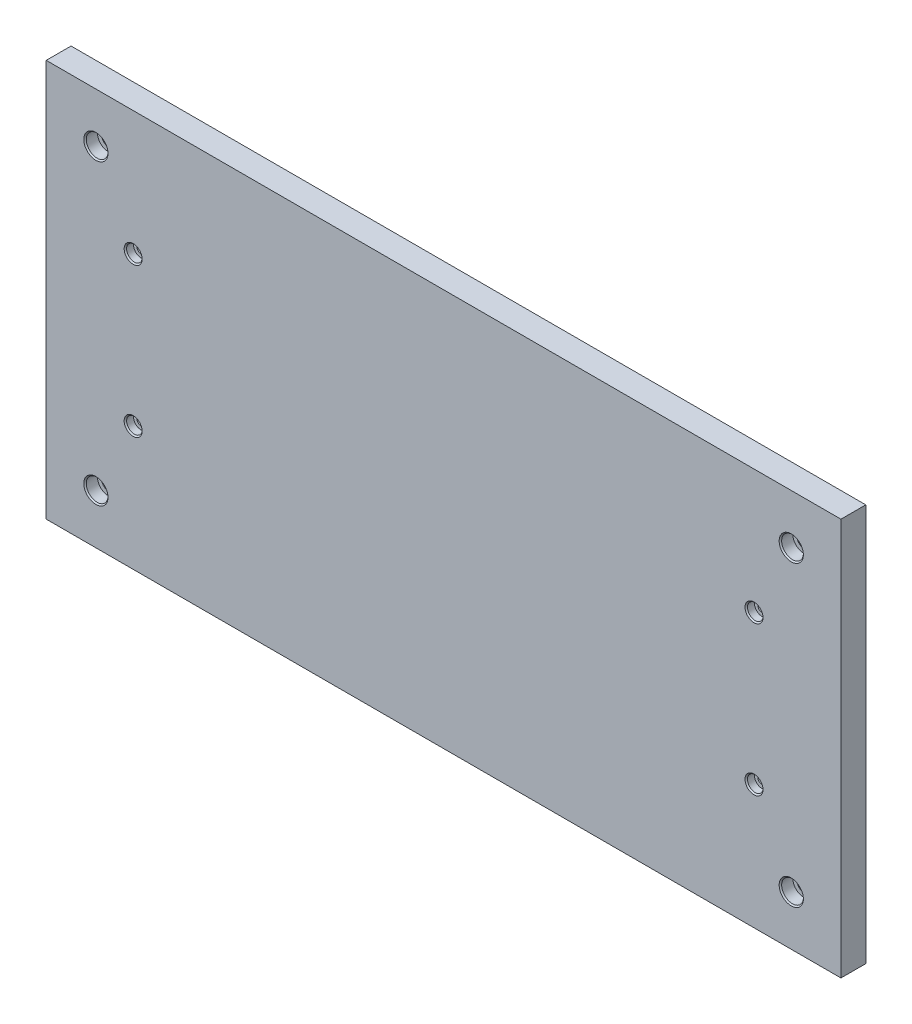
from build123d import *

# Parameters (mm, degrees)
SKETCH1_W                                     = 406.4
SKETCH1_H                                     = 203.2
BOSS_EXTRUDE1_DEPTH                           = 12.7
CBORE_FOR_1_4_SOCKET_HEAD_CAP_SCREW1_AT_COUNT = 2
CBORE_FOR_1_4_SOCKET_HEAD_CAP_SCREW1_AT_PITCH = 152.4
CBORE_FOR_1_4_SOCKET_HEAD_CAP_SCREW1_2_COUNT  = 2
CBORE_FOR_1_4_SOCKET_HEAD_CAP_SCREW1_2_PITCH  = 386.881273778
CBORE_FOR_1_4_SOCKET_HEAD_CAP_SCREW1_3_COUNT  = 2
CBORE_FOR_1_4_SOCKET_HEAD_CAP_SCREW1_3_PITCH  = 355.6
CBORE_FOR_8_SOCKET_HEAD_CAP_SCREW2_AT_2_COUNT = 2
CBORE_FOR_8_SOCKET_HEAD_CAP_SCREW2_AT_2_PITCH = 326.515987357
CBORE_FOR_8_SOCKET_HEAD_CAP_SCREW2_AT_3_COUNT = 2
CBORE_FOR_8_SOCKET_HEAD_CAP_SCREW2_AT_3_PITCH = 317.5


with BuildPart() as part:
    # Sketch1 → Boss-Extrude1 (new body)
    with BuildSketch(Plane.XY):
        with Locations((95.867780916, -141.83523601)):
            Rectangle(SKETCH1_W, SKETCH1_H)
    extrude(amount=BOSS_EXTRUDE1_DEPTH)

    # Sketch3 → CBORE for 1_4 Socket Head Cap Screw1 (revolve, cut)
    with BuildSketch(Plane(origin=(-81.932219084, -65.63523601, 12.7), x_dir=(0, -1, 0), z_dir=(1, 0, 0))):
        Polygon((0, 0), (0, 12.7), (3.3782, 12.7), (3.3782, 6.35), (5.55625, 6.35), (5.55625, 0.635), (6.19125, 0), align=None)
    cbore_for_1_4_socket_head_cap_screw1 = revolve(axis=Axis((-81.932219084, -65.63523601, 19.05), (0, 0, -1)), mode=Mode.SUBTRACT)

    # CBORE for 1_4 Socket Head Cap Screw1 at: CBORE for 1_4 Socket Head Cap Screw1 ×2
    with Locations(*[(0, -i * CBORE_FOR_1_4_SOCKET_HEAD_CAP_SCREW1_AT_PITCH, 0) for i in range(1, CBORE_FOR_1_4_SOCKET_HEAD_CAP_SCREW1_AT_COUNT)]):
        add(cbore_for_1_4_socket_head_cap_screw1, mode=Mode.SUBTRACT)

    # CBORE for 1_4 Socket Head Cap Screw1 2: CBORE for 1_4 Socket Head Cap Screw1 ×2
    with Locations(*[Vector(0.919145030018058, -0.39391929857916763, 0) * (i * CBORE_FOR_1_4_SOCKET_HEAD_CAP_SCREW1_2_PITCH) for i in range(1, CBORE_FOR_1_4_SOCKET_HEAD_CAP_SCREW1_2_COUNT)]):
        add(cbore_for_1_4_socket_head_cap_screw1, mode=Mode.SUBTRACT)

    # CBORE for 1_4 Socket Head Cap Screw1 3: CBORE for 1_4 Socket Head Cap Screw1 ×2
    with Locations(*[(i * CBORE_FOR_1_4_SOCKET_HEAD_CAP_SCREW1_3_PITCH, 0, 0) for i in range(1, CBORE_FOR_1_4_SOCKET_HEAD_CAP_SCREW1_3_COUNT)]):
        add(cbore_for_1_4_socket_head_cap_screw1, mode=Mode.SUBTRACT)

    # Sketch5 → CBORE for _8 Socket Head Cap Screw1 (revolve, cut)
    with BuildSketch(Plane(origin=(-62.882219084, -103.73523601, 12.7), x_dir=(0, -1, 0), z_dir=(1, 0, 0))):
        Polygon((0, 0), (0, 11.510674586), (2.2479, 10.16), (2.2479, 4.1656), (3.96875, 4.1656), (3.96875, 0.635), (4.60375, 0), align=None)
    revolve(axis=Axis((-62.882219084, -103.73523601, 19.05), (0, 0, -1)), mode=Mode.SUBTRACT)

    # Sketch7 → CBORE for _8 Socket Head Cap Screw2 (revolve, cut)
    with BuildSketch(Plane(origin=(-62.882219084, -179.93523601, 12.7), x_dir=(0, -1, 0), z_dir=(1, 0, 0))):
        Polygon((0, 0), (0, 11.510674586), (2.2479, 10.16), (2.2479, 4.1656), (3.96875, 4.1656), (3.96875, 0.635), (4.60375, 0), align=None)
    cbore_for_8_socket_head_cap_screw2 = revolve(axis=Axis((-62.882219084, -179.93523601, 19.05), (0, 0, -1)), mode=Mode.SUBTRACT)

    # CBORE for _8 Socket Head Cap Screw2 at 2: CBORE for _8 Socket Head Cap Screw2 ×2
    with Locations(*[Vector(0.9723873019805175, 0.23337295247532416, 0) * (i * CBORE_FOR_8_SOCKET_HEAD_CAP_SCREW2_AT_2_PITCH) for i in range(1, CBORE_FOR_8_SOCKET_HEAD_CAP_SCREW2_AT_2_COUNT)]):
        add(cbore_for_8_socket_head_cap_screw2, mode=Mode.SUBTRACT)

    # CBORE for _8 Socket Head Cap Screw2 at 3: CBORE for _8 Socket Head Cap Screw2 ×2
    with Locations(*[(i * CBORE_FOR_8_SOCKET_HEAD_CAP_SCREW2_AT_3_PITCH, 0, 0) for i in range(1, CBORE_FOR_8_SOCKET_HEAD_CAP_SCREW2_AT_3_COUNT)]):
        add(cbore_for_8_socket_head_cap_screw2, mode=Mode.SUBTRACT)


solid = part.part
